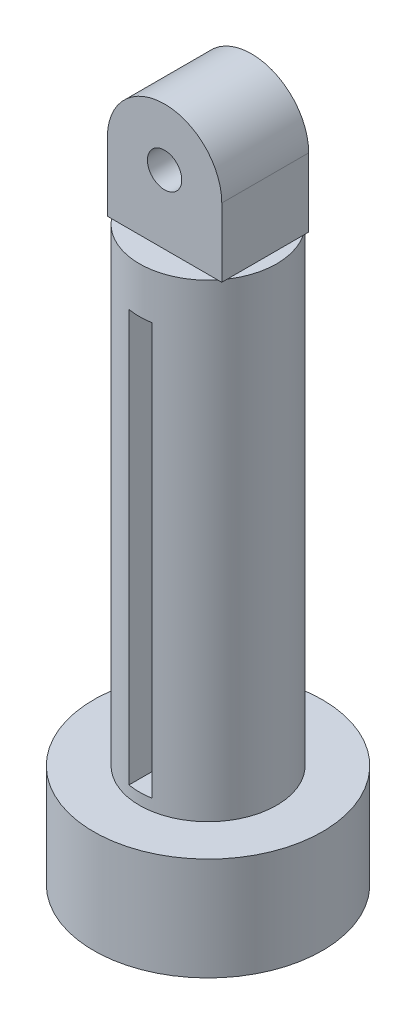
ISO-10303-21;
HEADER;
FILE_DESCRIPTION(('STEP AP214'),'2;1');
FILE_NAME('part.step','',(''),(''),'','','');
FILE_SCHEMA(('AUTOMOTIVE_DESIGN { 1 0 10303 214 1 1 1 1 }'));
ENDSEC;
DATA;
#1=APPLICATION_CONTEXT('core data for automotive mechanical design processes');
#2=APPLICATION_PROTOCOL_DEFINITION('international standard','automotive_design',2000,#1);
#3=PRODUCT_CONTEXT('',#1,'mechanical');
#4=PRODUCT('Part','Part','',(#3));
#5=PRODUCT_RELATED_PRODUCT_CATEGORY('part','',(#4));
#6=PRODUCT_DEFINITION_FORMATION('','',#4);
#7=PRODUCT_DEFINITION_CONTEXT('part definition',#1,'design');
#8=PRODUCT_DEFINITION('design','',#6,#7);
#9=PRODUCT_DEFINITION_SHAPE('','',#8);
#10=(LENGTH_UNIT() NAMED_UNIT(*) SI_UNIT(.MILLI.,.METRE.));
#11=(NAMED_UNIT(*) PLANE_ANGLE_UNIT() SI_UNIT($,.RADIAN.));
#12=(NAMED_UNIT(*) SI_UNIT($,.STERADIAN.) SOLID_ANGLE_UNIT());
#13=UNCERTAINTY_MEASURE_WITH_UNIT(LENGTH_MEASURE(1.E-05),#10,'distance_accuracy_value','');
#14=(GEOMETRIC_REPRESENTATION_CONTEXT(3) GLOBAL_UNCERTAINTY_ASSIGNED_CONTEXT((#13)) GLOBAL_UNIT_ASSIGNED_CONTEXT((#10,
#11,#12)) REPRESENTATION_CONTEXT('',''));
#15=CARTESIAN_POINT('',(0.,0.,0.));
#16=DIRECTION('',(0.,0.,1.));
#17=DIRECTION('',(1.,0.,0.));
#18=AXIS2_PLACEMENT_3D('',#15,#16,#17);
#19=CARTESIAN_POINT('',(-23.3830845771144,26.5671641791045,8.));
#20=DIRECTION('',(1.,0.,0.));
#21=DIRECTION('',(0.,0.,-1.));
#22=AXIS2_PLACEMENT_3D('',#19,#20,#21);
#23=PLANE('',#22);
#24=DIRECTION('',(0.,1.,0.));
#25=VECTOR('',#24,1.);
#26=CARTESIAN_POINT('',(-23.3830845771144,15.5671641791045,0.2));
#27=LINE('',#26,#25);
#28=CARTESIAN_POINT('',(-23.3830845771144,15.5671641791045,0.2));
#29=VERTEX_POINT('',#28);
#30=CARTESIAN_POINT('',(-23.3830845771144,21.5671641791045,0.2));
#31=VERTEX_POINT('',#30);
#32=EDGE_CURVE('E198',#29,#31,#27,.T.);
#33=ORIENTED_EDGE('',*,*,#32,.F.);
#34=DIRECTION('',(0.,0.,-1.));
#35=VECTOR('',#34,1.);
#36=CARTESIAN_POINT('',(-23.3830845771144,15.5671641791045,8.));
#37=LINE('',#36,#35);
#38=CARTESIAN_POINT('',(-23.3830845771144,15.5671641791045,0.683375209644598));
#39=VERTEX_POINT('',#38);
#40=EDGE_CURVE('E230',#39,#29,#37,.T.);
#41=ORIENTED_EDGE('',*,*,#40,.F.);
#42=CARTESIAN_POINT('',(-23.3830845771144,15.5671641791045,7.3166247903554));
#43=VERTEX_POINT('',#42);
#44=EDGE_CURVE('E235',#43,#39,#37,.T.);
#45=ORIENTED_EDGE('',*,*,#44,.F.);
#46=CARTESIAN_POINT('',(-23.3830845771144,15.5671641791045,7.8));
#47=VERTEX_POINT('',#46);
#48=EDGE_CURVE('E232',#47,#43,#37,.T.);
#49=ORIENTED_EDGE('',*,*,#48,.F.);
#50=DIRECTION('',(0.,-1.,0.));
#51=VECTOR('',#50,1.);
#52=CARTESIAN_POINT('',(-23.3830845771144,21.5671641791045,7.8));
#53=LINE('',#52,#51);
#54=CARTESIAN_POINT('',(-23.3830845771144,21.5671641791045,7.8));
#55=VERTEX_POINT('',#54);
#56=EDGE_CURVE('E244',#55,#47,#53,.T.);
#57=ORIENTED_EDGE('',*,*,#56,.F.);
#58=DIRECTION('',(0.,0.,1.));
#59=VECTOR('',#58,1.);
#60=CARTESIAN_POINT('',(-23.3830845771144,21.5671641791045,0.));
#61=LINE('',#60,#59);
#62=EDGE_CURVE('E218',#31,#55,#61,.T.);
#63=ORIENTED_EDGE('',*,*,#62,.F.);
#64=EDGE_LOOP('',(#33,#41,#45,#49,#57,#63));
#65=FACE_BOUND('',#64,.T.);
#66=ADVANCED_FACE('F79',(#65),#23,.F.);
#67=CARTESIAN_POINT('',(-13.3830845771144,26.5671641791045,8.));
#68=DIRECTION('',(-1.,0.,0.));
#69=DIRECTION('',(0.,-1.,0.));
#70=AXIS2_PLACEMENT_3D('',#67,#68,#69);
#71=PLANE('',#70);
#72=DIRECTION('',(0.,-1.,0.));
#73=VECTOR('',#72,1.);
#74=CARTESIAN_POINT('',(-13.3830845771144,21.5671641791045,0.2));
#75=LINE('',#74,#73);
#76=CARTESIAN_POINT('',(-13.3830845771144,21.5671641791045,0.2));
#77=VERTEX_POINT('',#76);
#78=CARTESIAN_POINT('',(-13.3830845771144,15.5671641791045,0.2));
#79=VERTEX_POINT('',#78);
#80=EDGE_CURVE('E195',#77,#79,#75,.T.);
#81=ORIENTED_EDGE('',*,*,#80,.F.);
#82=DIRECTION('',(0.,0.,1.));
#83=VECTOR('',#82,1.);
#84=CARTESIAN_POINT('',(-13.3830845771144,21.5671641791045,0.));
#85=LINE('',#84,#83);
#86=CARTESIAN_POINT('',(-13.3830845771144,21.5671641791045,7.8));
#87=VERTEX_POINT('',#86);
#88=EDGE_CURVE('E207',#77,#87,#85,.T.);
#89=ORIENTED_EDGE('',*,*,#88,.T.);
#90=DIRECTION('',(0.,1.,0.));
#91=VECTOR('',#90,1.);
#92=CARTESIAN_POINT('',(-13.3830845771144,15.5671641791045,7.8));
#93=LINE('',#92,#91);
#94=CARTESIAN_POINT('',(-13.3830845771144,15.5671641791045,7.8));
#95=VERTEX_POINT('',#94);
#96=EDGE_CURVE('E255',#95,#87,#93,.T.);
#97=ORIENTED_EDGE('',*,*,#96,.F.);
#98=DIRECTION('',(0.,0.,-1.));
#99=VECTOR('',#98,1.);
#100=CARTESIAN_POINT('',(-13.3830845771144,15.5671641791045,8.));
#101=LINE('',#100,#99);
#102=CARTESIAN_POINT('',(-13.3830845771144,15.5671641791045,7.3166247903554));
#103=VERTEX_POINT('',#102);
#104=EDGE_CURVE('E228',#95,#103,#101,.T.);
#105=ORIENTED_EDGE('',*,*,#104,.T.);
#106=CARTESIAN_POINT('',(-13.3830845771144,15.5671641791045,0.683375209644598));
#107=VERTEX_POINT('',#106);
#108=EDGE_CURVE('E231',#103,#107,#101,.T.);
#109=ORIENTED_EDGE('',*,*,#108,.T.);
#110=EDGE_CURVE('E211',#107,#79,#101,.T.);
#111=ORIENTED_EDGE('',*,*,#110,.T.);
#112=EDGE_LOOP('',(#81,#89,#97,#105,#109,#111));
#113=FACE_BOUND('',#112,.T.);
#114=ADVANCED_FACE('F205',(#113),#71,.F.);
#115=CARTESIAN_POINT('',(-18.3830845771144,21.5671641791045,0.));
#116=DIRECTION('',(0.,0.,1.));
#117=DIRECTION('',(1.,0.,0.));
#118=AXIS2_PLACEMENT_3D('',#115,#116,#117);
#119=CYLINDRICAL_SURFACE('',#118,5.);
#120=ORIENTED_EDGE('',*,*,#88,.F.);
#121=CARTESIAN_POINT('',(-18.3830845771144,21.5671641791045,0.2));
#122=DIRECTION('',(0.,0.,-1.));
#123=DIRECTION('',(-1.,0.,0.));
#124=AXIS2_PLACEMENT_3D('',#121,#122,#123);
#125=CIRCLE('',#124,5.);
#126=EDGE_CURVE('E190',#31,#77,#125,.T.);
#127=ORIENTED_EDGE('',*,*,#126,.F.);
#128=ORIENTED_EDGE('',*,*,#62,.T.);
#129=CARTESIAN_POINT('',(-18.3830845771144,21.5671641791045,7.8));
#130=DIRECTION('',(0.,0.,1.));
#131=DIRECTION('',(1.,0.,0.));
#132=AXIS2_PLACEMENT_3D('',#129,#130,#131);
#133=CIRCLE('',#132,5.);
#134=EDGE_CURVE('E217',#87,#55,#133,.T.);
#135=ORIENTED_EDGE('',*,*,#134,.F.);
#136=EDGE_LOOP('',(#120,#127,#128,#135));
#137=FACE_BOUND('',#136,.T.);
#138=ADVANCED_FACE('F215',(#137),#119,.T.);
#139=CARTESIAN_POINT('',(-18.3830845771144,21.5671641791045,0.));
#140=DIRECTION('',(0.,0.,1.));
#141=DIRECTION('',(1.,0.,0.));
#142=AXIS2_PLACEMENT_3D('',#139,#140,#141);
#143=CYLINDRICAL_SURFACE('',#142,1.5);
#144=CARTESIAN_POINT('',(-18.3830845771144,21.5671641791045,7.8));
#145=DIRECTION('',(0.,0.,1.));
#146=DIRECTION('',(1.,0.,0.));
#147=AXIS2_PLACEMENT_3D('',#144,#145,#146);
#148=CIRCLE('',#147,1.5);
#149=CARTESIAN_POINT('',(-16.8830845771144,21.5671641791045,7.8));
#150=VERTEX_POINT('',#149);
#151=EDGE_CURVE('E241',#150,#150,#148,.F.);
#152=ORIENTED_EDGE('',*,*,#151,.F.);
#153=EDGE_LOOP('',(#152));
#154=FACE_BOUND('',#153,.T.);
#155=CARTESIAN_POINT('',(-18.3830845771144,21.5671641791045,0.2));
#156=DIRECTION('',(0.,0.,-1.));
#157=DIRECTION('',(-1.,0.,0.));
#158=AXIS2_PLACEMENT_3D('',#155,#156,#157);
#159=CIRCLE('',#158,1.5);
#160=CARTESIAN_POINT('',(-19.8830845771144,21.5671641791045,0.2));
#161=VERTEX_POINT('',#160);
#162=EDGE_CURVE('E376',#161,#161,#159,.F.);
#163=ORIENTED_EDGE('',*,*,#162,.F.);
#164=EDGE_LOOP('',(#163));
#165=FACE_BOUND('',#164,.T.);
#166=ADVANCED_FACE('F422',(#154,#165),#143,.F.);
#167=CARTESIAN_POINT('',(-23.3830845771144,15.5671641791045,8.));
#168=DIRECTION('',(0.,1.,0.));
#169=DIRECTION('',(0.,0.,1.));
#170=AXIS2_PLACEMENT_3D('',#167,#168,#169);
#171=PLANE('',#170);
#172=DIRECTION('',(-1.,0.,0.));
#173=VECTOR('',#172,1.);
#174=CARTESIAN_POINT('',(-13.3830845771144,15.5671641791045,0.2));
#175=LINE('',#174,#173);
#176=CARTESIAN_POINT('',(-13.7398098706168,15.5671641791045,0.2));
#177=VERTEX_POINT('',#176);
#178=EDGE_CURVE('E377',#79,#177,#175,.T.);
#179=ORIENTED_EDGE('',*,*,#178,.F.);
#180=ORIENTED_EDGE('',*,*,#110,.F.);
#181=CARTESIAN_POINT('',(-18.3830845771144,15.5671641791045,4.));
#182=DIRECTION('',(0.,-1.,0.));
#183=DIRECTION('',(0.,0.,-1.));
#184=AXIS2_PLACEMENT_3D('',#181,#182,#183);
#185=CIRCLE('',#184,6.);
#186=EDGE_CURVE('E223',#177,#107,#185,.T.);
#187=ORIENTED_EDGE('',*,*,#186,.F.);
#188=EDGE_LOOP('',(#179,#180,#187));
#189=FACE_BOUND('',#188,.T.);
#190=ADVANCED_FACE('F399',(#189),#171,.F.);
#191=DIRECTION('',(-1.,0.,0.));
#192=VECTOR('',#191,1.);
#193=CARTESIAN_POINT('',(-23.3830845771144,15.5671641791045,0.2));
#194=LINE('',#193,#192);
#195=CARTESIAN_POINT('',(-23.026359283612,15.5671641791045,0.2));
#196=VERTEX_POINT('',#195);
#197=EDGE_CURVE('E12',#196,#29,#194,.T.);
#198=ORIENTED_EDGE('',*,*,#197,.F.);
#199=EDGE_CURVE('E225',#39,#196,#185,.T.);
#200=ORIENTED_EDGE('',*,*,#199,.F.);
#201=ORIENTED_EDGE('',*,*,#40,.T.);
#202=EDGE_LOOP('',(#198,#200,#201));
#203=FACE_BOUND('',#202,.T.);
#204=ADVANCED_FACE('F381',(#203),#171,.F.);
#205=DIRECTION('',(1.,0.,0.));
#206=VECTOR('',#205,1.);
#207=CARTESIAN_POINT('',(-13.9109486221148,15.5671641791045,7.8));
#208=LINE('',#207,#206);
#209=CARTESIAN_POINT('',(-13.7398098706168,15.5671641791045,7.8));
#210=VERTEX_POINT('',#209);
#211=EDGE_CURVE('E445',#210,#95,#208,.T.);
#212=ORIENTED_EDGE('',*,*,#211,.F.);
#213=EDGE_CURVE('E239',#103,#210,#185,.T.);
#214=ORIENTED_EDGE('',*,*,#213,.F.);
#215=ORIENTED_EDGE('',*,*,#104,.F.);
#216=EDGE_LOOP('',(#212,#214,#215));
#217=FACE_BOUND('',#216,.T.);
#218=ADVANCED_FACE('F432',(#217),#171,.F.);
#219=CARTESIAN_POINT('',(-23.026359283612,15.5671641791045,7.8));
#220=VERTEX_POINT('',#219);
#221=EDGE_CURVE('E441',#47,#220,#208,.T.);
#222=ORIENTED_EDGE('',*,*,#221,.F.);
#223=ORIENTED_EDGE('',*,*,#48,.T.);
#224=EDGE_CURVE('E391',#220,#43,#185,.T.);
#225=ORIENTED_EDGE('',*,*,#224,.F.);
#226=EDGE_LOOP('',(#222,#223,#225));
#227=FACE_BOUND('',#226,.T.);
#228=ADVANCED_FACE('F428',(#227),#171,.F.);
#229=CARTESIAN_POINT('',(0.,-29.4328358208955,0.));
#230=DIRECTION('',(0.,-1.,0.));
#231=DIRECTION('',(0.,0.,-1.));
#232=AXIS2_PLACEMENT_3D('',#229,#230,#231);
#233=PLANE('',#232);
#234=CARTESIAN_POINT('',(-18.3830845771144,-29.4328358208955,4.));
#235=DIRECTION('',(0.,-1.,0.));
#236=DIRECTION('',(0.,0.,-1.));
#237=AXIS2_PLACEMENT_3D('',#234,#235,#236);
#238=CIRCLE('',#237,3.25);
#239=CARTESIAN_POINT('',(-18.3830845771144,-29.4328358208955,0.749999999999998));
#240=VERTEX_POINT('',#239);
#241=EDGE_CURVE('E317',#240,#240,#238,.T.);
#242=ORIENTED_EDGE('',*,*,#241,.F.);
#243=EDGE_LOOP('',(#242));
#244=FACE_BOUND('',#243,.T.);
#245=CARTESIAN_POINT('',(-18.3830845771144,-29.4328358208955,4.));
#246=DIRECTION('',(0.,-1.,0.));
#247=DIRECTION('',(0.,0.,-1.));
#248=AXIS2_PLACEMENT_3D('',#245,#246,#247);
#249=CIRCLE('',#248,8.);
#250=CARTESIAN_POINT('',(-18.3830845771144,-29.4328358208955,-4.));
#251=VERTEX_POINT('',#250);
#252=EDGE_CURVE('E86',#251,#251,#249,.F.);
#253=ORIENTED_EDGE('',*,*,#252,.F.);
#254=EDGE_LOOP('',(#253));
#255=FACE_BOUND('',#254,.T.);
#256=ADVANCED_FACE('F418',(#244,#255),#233,.T.);
#257=CARTESIAN_POINT('',(-18.3830845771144,-29.4328358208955,4.));
#258=DIRECTION('',(0.,1.,0.));
#259=DIRECTION('',(0.,0.,1.));
#260=AXIS2_PLACEMENT_3D('',#257,#258,#259);
#261=CYLINDRICAL_SURFACE('',#260,6.);
#262=CARTESIAN_POINT('',(-18.3830845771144,11.5671641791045,4.));
#263=DIRECTION('',(0.,-1.,0.));
#264=DIRECTION('',(0.,0.,-1.));
#265=AXIS2_PLACEMENT_3D('',#262,#263,#264);
#266=CIRCLE('',#265,6.);
#267=CARTESIAN_POINT('',(-17.3830845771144,11.5671641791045,9.91607978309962));
#268=VERTEX_POINT('',#267);
#269=CARTESIAN_POINT('',(-19.3830845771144,11.5671641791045,9.91607978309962));
#270=VERTEX_POINT('',#269);
#271=EDGE_CURVE('E275',#268,#270,#266,.T.);
#272=ORIENTED_EDGE('',*,*,#271,.F.);
#273=DIRECTION('',(0.,-1.,0.));
#274=VECTOR('',#273,1.);
#275=CARTESIAN_POINT('',(-17.3830845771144,11.5671641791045,9.91607978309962));
#276=LINE('',#275,#274);
#277=CARTESIAN_POINT('',(-17.3830845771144,-24.4328358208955,9.91607978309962));
#278=VERTEX_POINT('',#277);
#279=EDGE_CURVE('E286',#268,#278,#276,.T.);
#280=ORIENTED_EDGE('',*,*,#279,.T.);
#281=CARTESIAN_POINT('',(-18.3830845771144,-24.4328358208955,4.));
#282=DIRECTION('',(0.,-1.,0.));
#283=DIRECTION('',(0.,0.,-1.));
#284=AXIS2_PLACEMENT_3D('',#281,#282,#283);
#285=CIRCLE('',#284,6.);
#286=CARTESIAN_POINT('',(-19.3830845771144,-24.4328358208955,9.91607978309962));
#287=VERTEX_POINT('',#286);
#288=EDGE_CURVE('E268',#278,#287,#285,.T.);
#289=ORIENTED_EDGE('',*,*,#288,.T.);
#290=DIRECTION('',(0.,-1.,0.));
#291=VECTOR('',#290,1.);
#292=CARTESIAN_POINT('',(-19.3830845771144,11.5671641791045,9.91607978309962));
#293=LINE('',#292,#291);
#294=EDGE_CURVE('E284',#270,#287,#293,.T.);
#295=ORIENTED_EDGE('',*,*,#294,.F.);
#296=EDGE_LOOP('',(#272,#280,#289,#295));
#297=FACE_BOUND('',#296,.T.);
#298=DIRECTION('',(0.,1.,0.));
#299=VECTOR('',#298,1.);
#300=CARTESIAN_POINT('',(-19.3830845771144,-24.4328358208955,-1.91607978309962));
#301=LINE('',#300,#299);
#302=CARTESIAN_POINT('',(-19.3830845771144,-24.4328358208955,-1.91607978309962));
#303=VERTEX_POINT('',#302);
#304=CARTESIAN_POINT('',(-19.3830845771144,11.5671641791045,-1.91607978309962));
#305=VERTEX_POINT('',#304);
#306=EDGE_CURVE('E312',#303,#305,#301,.T.);
#307=ORIENTED_EDGE('',*,*,#306,.F.);
#308=CARTESIAN_POINT('',(-18.3830845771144,-24.4328358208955,4.));
#309=DIRECTION('',(0.,-1.,0.));
#310=DIRECTION('',(0.,0.,-1.));
#311=AXIS2_PLACEMENT_3D('',#308,#309,#310);
#312=CIRCLE('',#311,6.);
#313=CARTESIAN_POINT('',(-17.3830845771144,-24.4328358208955,-1.91607978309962));
#314=VERTEX_POINT('',#313);
#315=EDGE_CURVE('E301',#303,#314,#312,.T.);
#316=ORIENTED_EDGE('',*,*,#315,.T.);
#317=DIRECTION('',(0.,1.,0.));
#318=VECTOR('',#317,1.);
#319=CARTESIAN_POINT('',(-17.3830845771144,-24.4328358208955,-1.91607978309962));
#320=LINE('',#319,#318);
#321=CARTESIAN_POINT('',(-17.3830845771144,11.5671641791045,-1.91607978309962));
#322=VERTEX_POINT('',#321);
#323=EDGE_CURVE('E309',#314,#322,#320,.T.);
#324=ORIENTED_EDGE('',*,*,#323,.T.);
#325=CARTESIAN_POINT('',(-18.3830845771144,11.5671641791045,4.));
#326=DIRECTION('',(0.,-1.,0.));
#327=DIRECTION('',(0.,0.,-1.));
#328=AXIS2_PLACEMENT_3D('',#325,#326,#327);
#329=CIRCLE('',#328,6.);
#330=EDGE_CURVE('E291',#305,#322,#329,.T.);
#331=ORIENTED_EDGE('',*,*,#330,.F.);
#332=EDGE_LOOP('',(#307,#316,#324,#331));
#333=FACE_BOUND('',#332,.T.);
#334=EDGE_CURVE('E219',#196,#177,#185,.T.);
#335=ORIENTED_EDGE('',*,*,#334,.T.);
#336=ORIENTED_EDGE('',*,*,#186,.T.);
#337=EDGE_CURVE('E392',#107,#103,#185,.T.);
#338=ORIENTED_EDGE('',*,*,#337,.T.);
#339=ORIENTED_EDGE('',*,*,#213,.T.);
#340=EDGE_CURVE('E394',#210,#220,#185,.T.);
#341=ORIENTED_EDGE('',*,*,#340,.T.);
#342=ORIENTED_EDGE('',*,*,#224,.T.);
#343=EDGE_CURVE('E320',#43,#39,#185,.T.);
#344=ORIENTED_EDGE('',*,*,#343,.T.);
#345=ORIENTED_EDGE('',*,*,#199,.T.);
#346=EDGE_LOOP('',(#335,#336,#338,#339,#341,#342,#344,#345));
#347=FACE_BOUND('',#346,.T.);
#348=CARTESIAN_POINT('',(-18.3830845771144,-25.4328358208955,4.));
#349=DIRECTION('',(0.,-1.,0.));
#350=DIRECTION('',(0.,0.,-1.));
#351=AXIS2_PLACEMENT_3D('',#348,#349,#350);
#352=CIRCLE('',#351,6.);
#353=CARTESIAN_POINT('',(-18.3830845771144,-25.4328358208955,-2.));
#354=VERTEX_POINT('',#353);
#355=EDGE_CURVE('E236',#354,#354,#352,.T.);
#356=ORIENTED_EDGE('',*,*,#355,.F.);
#357=EDGE_LOOP('',(#356));
#358=FACE_BOUND('',#357,.T.);
#359=ADVANCED_FACE('F341',(#297,#333,#347,#358),#261,.T.);
#360=CARTESIAN_POINT('',(-18.3830845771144,11.5671641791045,4.));
#361=DIRECTION('',(0.,-1.,0.));
#362=DIRECTION('',(0.,0.,-1.));
#363=AXIS2_PLACEMENT_3D('',#360,#361,#362);
#364=CYLINDRICAL_SURFACE('',#363,3.25);
#365=ORIENTED_EDGE('',*,*,#241,.T.);
#366=EDGE_LOOP('',(#365));
#367=FACE_BOUND('',#366,.T.);
#368=DIRECTION('',(0.,-1.,0.));
#369=VECTOR('',#368,1.);
#370=CARTESIAN_POINT('',(-19.3830845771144,11.5671641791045,7.09232921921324));
#371=LINE('',#370,#369);
#372=CARTESIAN_POINT('',(-19.3830845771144,11.5671641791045,7.09232921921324));
#373=VERTEX_POINT('',#372);
#374=CARTESIAN_POINT('',(-19.3830845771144,-24.4328358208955,7.09232921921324));
#375=VERTEX_POINT('',#374);
#376=EDGE_CURVE('E281',#373,#375,#371,.T.);
#377=ORIENTED_EDGE('',*,*,#376,.T.);
#378=CARTESIAN_POINT('',(-18.3830845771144,-24.4328358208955,4.));
#379=DIRECTION('',(0.,-1.,0.));
#380=DIRECTION('',(0.,0.,-1.));
#381=AXIS2_PLACEMENT_3D('',#378,#379,#380);
#382=CIRCLE('',#381,3.25);
#383=CARTESIAN_POINT('',(-17.3830845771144,-24.4328358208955,7.09232921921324));
#384=VERTEX_POINT('',#383);
#385=EDGE_CURVE('E264',#384,#375,#382,.T.);
#386=ORIENTED_EDGE('',*,*,#385,.F.);
#387=DIRECTION('',(0.,-1.,0.));
#388=VECTOR('',#387,1.);
#389=CARTESIAN_POINT('',(-17.3830845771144,11.5671641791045,7.09232921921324));
#390=LINE('',#389,#388);
#391=CARTESIAN_POINT('',(-17.3830845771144,11.5671641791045,7.09232921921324));
#392=VERTEX_POINT('',#391);
#393=EDGE_CURVE('E280',#392,#384,#390,.T.);
#394=ORIENTED_EDGE('',*,*,#393,.F.);
#395=CARTESIAN_POINT('',(-18.3830845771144,11.5671641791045,4.));
#396=DIRECTION('',(0.,-1.,0.));
#397=DIRECTION('',(0.,0.,-1.));
#398=AXIS2_PLACEMENT_3D('',#395,#396,#397);
#399=CIRCLE('',#398,3.25);
#400=CARTESIAN_POINT('',(-17.3830845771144,11.5671641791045,0.907670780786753));
#401=VERTEX_POINT('',#400);
#402=EDGE_CURVE('E318',#401,#392,#399,.T.);
#403=ORIENTED_EDGE('',*,*,#402,.F.);
#404=DIRECTION('',(0.,1.,0.));
#405=VECTOR('',#404,1.);
#406=CARTESIAN_POINT('',(-17.3830845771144,-24.4328358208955,0.907670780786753));
#407=LINE('',#406,#405);
#408=CARTESIAN_POINT('',(-17.3830845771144,-24.4328358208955,0.907670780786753));
#409=VERTEX_POINT('',#408);
#410=EDGE_CURVE('E306',#409,#401,#407,.T.);
#411=ORIENTED_EDGE('',*,*,#410,.F.);
#412=CARTESIAN_POINT('',(-18.3830845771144,-24.4328358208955,4.));
#413=DIRECTION('',(0.,-1.,0.));
#414=DIRECTION('',(0.,0.,-1.));
#415=AXIS2_PLACEMENT_3D('',#412,#413,#414);
#416=CIRCLE('',#415,3.25);
#417=CARTESIAN_POINT('',(-19.3830845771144,-24.4328358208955,0.907670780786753));
#418=VERTEX_POINT('',#417);
#419=EDGE_CURVE('E295',#418,#409,#416,.T.);
#420=ORIENTED_EDGE('',*,*,#419,.F.);
#421=DIRECTION('',(0.,1.,0.));
#422=VECTOR('',#421,1.);
#423=CARTESIAN_POINT('',(-19.3830845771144,-24.4328358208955,0.907670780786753));
#424=LINE('',#423,#422);
#425=CARTESIAN_POINT('',(-19.3830845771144,11.5671641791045,0.907670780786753));
#426=VERTEX_POINT('',#425);
#427=EDGE_CURVE('E314',#418,#426,#424,.T.);
#428=ORIENTED_EDGE('',*,*,#427,.T.);
#429=EDGE_CURVE('E321',#373,#426,#399,.T.);
#430=ORIENTED_EDGE('',*,*,#429,.F.);
#431=EDGE_LOOP('',(#377,#386,#394,#403,#411,#420,#428,#430));
#432=FACE_BOUND('',#431,.T.);
#433=ADVANCED_FACE('F329',(#367,#432),#364,.F.);
#434=CARTESIAN_POINT('',(0.,15.5671641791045,0.));
#435=DIRECTION('',(0.,-1.,0.));
#436=DIRECTION('',(0.,0.,-1.));
#437=AXIS2_PLACEMENT_3D('',#434,#435,#436);
#438=PLANE('',#437);
#439=ORIENTED_EDGE('',*,*,#334,.F.);
#440=EDGE_CURVE('E212',#177,#196,#175,.T.);
#441=ORIENTED_EDGE('',*,*,#440,.F.);
#442=EDGE_LOOP('',(#439,#441));
#443=FACE_BOUND('',#442,.T.);
#444=ADVANCED_FACE('F406',(#443),#438,.F.);
#445=ORIENTED_EDGE('',*,*,#108,.F.);
#446=ORIENTED_EDGE('',*,*,#337,.F.);
#447=EDGE_LOOP('',(#445,#446));
#448=FACE_BOUND('',#447,.T.);
#449=ADVANCED_FACE('F404',(#448),#438,.F.);
#450=ORIENTED_EDGE('',*,*,#343,.F.);
#451=ORIENTED_EDGE('',*,*,#44,.T.);
#452=EDGE_LOOP('',(#450,#451));
#453=FACE_BOUND('',#452,.T.);
#454=ADVANCED_FACE('F386',(#453),#438,.F.);
#455=ORIENTED_EDGE('',*,*,#340,.F.);
#456=EDGE_CURVE('E443',#220,#210,#208,.T.);
#457=ORIENTED_EDGE('',*,*,#456,.F.);
#458=EDGE_LOOP('',(#455,#457));
#459=FACE_BOUND('',#458,.T.);
#460=ADVANCED_FACE('F412',(#459),#438,.F.);
#461=CARTESIAN_POINT('',(0.,11.5671641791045,0.));
#462=DIRECTION('',(0.,-1.,0.));
#463=DIRECTION('',(0.,0.,-1.));
#464=AXIS2_PLACEMENT_3D('',#461,#462,#463);
#465=PLANE('',#464);
#466=ORIENTED_EDGE('',*,*,#402,.T.);
#467=DIRECTION('',(0.,0.,1.));
#468=VECTOR('',#467,1.);
#469=CARTESIAN_POINT('',(-17.3830845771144,11.5671641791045,0.));
#470=LINE('',#469,#468);
#471=EDGE_CURVE('E272',#392,#268,#470,.T.);
#472=ORIENTED_EDGE('',*,*,#471,.T.);
#473=ORIENTED_EDGE('',*,*,#271,.T.);
#474=DIRECTION('',(0.,0.,1.));
#475=VECTOR('',#474,1.);
#476=CARTESIAN_POINT('',(-19.3830845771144,11.5671641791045,0.));
#477=LINE('',#476,#475);
#478=EDGE_CURVE('E278',#373,#270,#477,.T.);
#479=ORIENTED_EDGE('',*,*,#478,.F.);
#480=ORIENTED_EDGE('',*,*,#429,.T.);
#481=DIRECTION('',(0.,0.,1.));
#482=VECTOR('',#481,1.);
#483=CARTESIAN_POINT('',(-19.3830845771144,11.5671641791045,0.));
#484=LINE('',#483,#482);
#485=EDGE_CURVE('E101',#305,#426,#484,.T.);
#486=ORIENTED_EDGE('',*,*,#485,.F.);
#487=ORIENTED_EDGE('',*,*,#330,.T.);
#488=DIRECTION('',(0.,0.,1.));
#489=VECTOR('',#488,1.);
#490=CARTESIAN_POINT('',(-17.3830845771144,11.5671641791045,0.));
#491=LINE('',#490,#489);
#492=EDGE_CURVE('E293',#322,#401,#491,.T.);
#493=ORIENTED_EDGE('',*,*,#492,.T.);
#494=EDGE_LOOP('',(#466,#472,#473,#479,#480,#486,#487,#493));
#495=FACE_BOUND('',#494,.T.);
#496=ADVANCED_FACE('F327',(#495),#465,.T.);
#497=CARTESIAN_POINT('',(-19.3830845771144,-24.4328358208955,0.));
#498=DIRECTION('',(-1.,0.,0.));
#499=DIRECTION('',(0.,0.,1.));
#500=AXIS2_PLACEMENT_3D('',#497,#498,#499);
#501=PLANE('',#500);
#502=ORIENTED_EDGE('',*,*,#427,.F.);
#503=DIRECTION('',(0.,0.,1.));
#504=VECTOR('',#503,1.);
#505=CARTESIAN_POINT('',(-19.3830845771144,-24.4328358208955,0.));
#506=LINE('',#505,#504);
#507=EDGE_CURVE('E298',#303,#418,#506,.T.);
#508=ORIENTED_EDGE('',*,*,#507,.F.);
#509=ORIENTED_EDGE('',*,*,#306,.T.);
#510=ORIENTED_EDGE('',*,*,#485,.T.);
#511=EDGE_LOOP('',(#502,#508,#509,#510));
#512=FACE_BOUND('',#511,.T.);
#513=ADVANCED_FACE('F335',(#512),#501,.F.);
#514=CARTESIAN_POINT('',(-17.3830845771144,-24.4328358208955,0.));
#515=DIRECTION('',(-1.,0.,0.));
#516=DIRECTION('',(0.,0.,1.));
#517=AXIS2_PLACEMENT_3D('',#514,#515,#516);
#518=PLANE('',#517);
#519=ORIENTED_EDGE('',*,*,#323,.F.);
#520=DIRECTION('',(0.,0.,1.));
#521=VECTOR('',#520,1.);
#522=CARTESIAN_POINT('',(-17.3830845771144,-24.4328358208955,0.));
#523=LINE('',#522,#521);
#524=EDGE_CURVE('E304',#314,#409,#523,.T.);
#525=ORIENTED_EDGE('',*,*,#524,.T.);
#526=ORIENTED_EDGE('',*,*,#410,.T.);
#527=ORIENTED_EDGE('',*,*,#492,.F.);
#528=EDGE_LOOP('',(#519,#525,#526,#527));
#529=FACE_BOUND('',#528,.T.);
#530=ADVANCED_FACE('F346',(#529),#518,.T.);
#531=CARTESIAN_POINT('',(0.,-24.4328358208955,0.));
#532=DIRECTION('',(0.,-1.,0.));
#533=DIRECTION('',(0.,0.,-1.));
#534=AXIS2_PLACEMENT_3D('',#531,#532,#533);
#535=PLANE('',#534);
#536=ORIENTED_EDGE('',*,*,#419,.T.);
#537=ORIENTED_EDGE('',*,*,#524,.F.);
#538=ORIENTED_EDGE('',*,*,#315,.F.);
#539=ORIENTED_EDGE('',*,*,#507,.T.);
#540=EDGE_LOOP('',(#536,#537,#538,#539));
#541=FACE_BOUND('',#540,.T.);
#542=ADVANCED_FACE('F338',(#541),#535,.F.);
#543=CARTESIAN_POINT('',(-19.3830845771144,11.5671641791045,0.));
#544=DIRECTION('',(1.,0.,0.));
#545=DIRECTION('',(0.,0.,-1.));
#546=AXIS2_PLACEMENT_3D('',#543,#544,#545);
#547=PLANE('',#546);
#548=ORIENTED_EDGE('',*,*,#376,.F.);
#549=ORIENTED_EDGE('',*,*,#478,.T.);
#550=ORIENTED_EDGE('',*,*,#294,.T.);
#551=DIRECTION('',(0.,0.,1.));
#552=VECTOR('',#551,1.);
#553=CARTESIAN_POINT('',(-19.3830845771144,-24.4328358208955,0.));
#554=LINE('',#553,#552);
#555=EDGE_CURVE('E93',#375,#287,#554,.T.);
#556=ORIENTED_EDGE('',*,*,#555,.F.);
#557=EDGE_LOOP('',(#548,#549,#550,#556));
#558=FACE_BOUND('',#557,.T.);
#559=ADVANCED_FACE('F354',(#558),#547,.T.);
#560=CARTESIAN_POINT('',(-17.3830845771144,11.5671641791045,0.));
#561=DIRECTION('',(1.,0.,0.));
#562=DIRECTION('',(0.,0.,-1.));
#563=AXIS2_PLACEMENT_3D('',#560,#561,#562);
#564=PLANE('',#563);
#565=ORIENTED_EDGE('',*,*,#279,.F.);
#566=ORIENTED_EDGE('',*,*,#471,.F.);
#567=ORIENTED_EDGE('',*,*,#393,.T.);
#568=DIRECTION('',(0.,0.,1.));
#569=VECTOR('',#568,1.);
#570=CARTESIAN_POINT('',(-17.3830845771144,-24.4328358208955,0.));
#571=LINE('',#570,#569);
#572=EDGE_CURVE('E266',#384,#278,#571,.T.);
#573=ORIENTED_EDGE('',*,*,#572,.T.);
#574=EDGE_LOOP('',(#565,#566,#567,#573));
#575=FACE_BOUND('',#574,.T.);
#576=ADVANCED_FACE('F356',(#575),#564,.F.);
#577=CARTESIAN_POINT('',(0.,-24.4328358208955,0.));
#578=DIRECTION('',(0.,-1.,0.));
#579=DIRECTION('',(0.,0.,-1.));
#580=AXIS2_PLACEMENT_3D('',#577,#578,#579);
#581=PLANE('',#580);
#582=ORIENTED_EDGE('',*,*,#385,.T.);
#583=ORIENTED_EDGE('',*,*,#555,.T.);
#584=ORIENTED_EDGE('',*,*,#288,.F.);
#585=ORIENTED_EDGE('',*,*,#572,.F.);
#586=EDGE_LOOP('',(#582,#583,#584,#585));
#587=FACE_BOUND('',#586,.T.);
#588=ADVANCED_FACE('F362',(#587),#581,.F.);
#589=CARTESIAN_POINT('',(-18.3830845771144,-25.4328358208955,4.));
#590=DIRECTION('',(0.,-1.,0.));
#591=DIRECTION('',(0.,0.,-1.));
#592=AXIS2_PLACEMENT_3D('',#589,#590,#591);
#593=CYLINDRICAL_SURFACE('',#592,10.);
#594=CARTESIAN_POINT('',(-18.3830845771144,-25.4328358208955,4.));
#595=DIRECTION('',(0.,-1.,0.));
#596=DIRECTION('',(0.,0.,-1.));
#597=AXIS2_PLACEMENT_3D('',#594,#595,#596);
#598=CIRCLE('',#597,10.);
#599=CARTESIAN_POINT('',(-18.3830845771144,-25.4328358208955,-6.));
#600=VERTEX_POINT('',#599);
#601=EDGE_CURVE('E261',#600,#600,#598,.T.);
#602=ORIENTED_EDGE('',*,*,#601,.T.);
#603=EDGE_LOOP('',(#602));
#604=FACE_BOUND('',#603,.T.);
#605=CARTESIAN_POINT('',(-18.3830845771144,-34.4328358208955,4.));
#606=DIRECTION('',(0.,-1.,0.));
#607=DIRECTION('',(0.,0.,-1.));
#608=AXIS2_PLACEMENT_3D('',#605,#606,#607);
#609=CIRCLE('',#608,10.);
#610=CARTESIAN_POINT('',(-18.3830845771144,-34.4328358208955,-6.));
#611=VERTEX_POINT('',#610);
#612=EDGE_CURVE('E248',#611,#611,#609,.T.);
#613=ORIENTED_EDGE('',*,*,#612,.F.);
#614=EDGE_LOOP('',(#613));
#615=FACE_BOUND('',#614,.T.);
#616=ADVANCED_FACE('F472',(#604,#615),#593,.T.);
#617=CARTESIAN_POINT('',(0.,-25.4328358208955,0.));
#618=DIRECTION('',(0.,-1.,0.));
#619=DIRECTION('',(0.,0.,-1.));
#620=AXIS2_PLACEMENT_3D('',#617,#618,#619);
#621=PLANE('',#620);
#622=ORIENTED_EDGE('',*,*,#355,.T.);
#623=EDGE_LOOP('',(#622));
#624=FACE_BOUND('',#623,.T.);
#625=ORIENTED_EDGE('',*,*,#601,.F.);
#626=EDGE_LOOP('',(#625));
#627=FACE_BOUND('',#626,.T.);
#628=ADVANCED_FACE('F468',(#624,#627),#621,.F.);
#629=CARTESIAN_POINT('',(-18.3830845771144,-34.4328358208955,4.));
#630=DIRECTION('',(0.,-1.,0.));
#631=DIRECTION('',(0.,0.,-1.));
#632=AXIS2_PLACEMENT_3D('',#629,#630,#631);
#633=PLANE('',#632);
#634=ORIENTED_EDGE('',*,*,#612,.T.);
#635=EDGE_LOOP('',(#634));
#636=FACE_BOUND('',#635,.T.);
#637=CARTESIAN_POINT('',(-18.3830845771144,-34.4328358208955,4.));
#638=DIRECTION('',(0.,-1.,0.));
#639=DIRECTION('',(0.,0.,-1.));
#640=AXIS2_PLACEMENT_3D('',#637,#638,#639);
#641=CIRCLE('',#640,8.);
#642=CARTESIAN_POINT('',(-18.3830845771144,-34.4328358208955,-4.));
#643=VERTEX_POINT('',#642);
#644=EDGE_CURVE('E243',#643,#643,#641,.T.);
#645=ORIENTED_EDGE('',*,*,#644,.F.);
#646=EDGE_LOOP('',(#645));
#647=FACE_BOUND('',#646,.T.);
#648=ADVANCED_FACE('F464',(#636,#647),#633,.T.);
#649=CARTESIAN_POINT('',(-18.3830845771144,-34.4328358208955,4.));
#650=DIRECTION('',(0.,1.,0.));
#651=DIRECTION('',(0.,0.,1.));
#652=AXIS2_PLACEMENT_3D('',#649,#650,#651);
#653=CYLINDRICAL_SURFACE('',#652,8.);
#654=ORIENTED_EDGE('',*,*,#644,.T.);
#655=EDGE_LOOP('',(#654));
#656=FACE_BOUND('',#655,.T.);
#657=ORIENTED_EDGE('',*,*,#252,.T.);
#658=EDGE_LOOP('',(#657));
#659=FACE_BOUND('',#658,.T.);
#660=ADVANCED_FACE('F459',(#656,#659),#653,.F.);
#661=CARTESIAN_POINT('',(-18.3830845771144,21.5671641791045,7.8));
#662=DIRECTION('',(0.,0.,1.));
#663=DIRECTION('',(1.,0.,0.));
#664=AXIS2_PLACEMENT_3D('',#661,#662,#663);
#665=PLANE('',#664);
#666=ORIENTED_EDGE('',*,*,#221,.T.);
#667=ORIENTED_EDGE('',*,*,#456,.T.);
#668=ORIENTED_EDGE('',*,*,#211,.T.);
#669=ORIENTED_EDGE('',*,*,#96,.T.);
#670=ORIENTED_EDGE('',*,*,#134,.T.);
#671=ORIENTED_EDGE('',*,*,#56,.T.);
#672=EDGE_LOOP('',(#666,#667,#668,#669,#670,#671));
#673=FACE_BOUND('',#672,.T.);
#674=ORIENTED_EDGE('',*,*,#151,.T.);
#675=EDGE_LOOP('',(#674));
#676=FACE_BOUND('',#675,.T.);
#677=ADVANCED_FACE('F454',(#673,#676),#665,.T.);
#678=CARTESIAN_POINT('',(-18.3830845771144,21.5671641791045,0.2));
#679=DIRECTION('',(0.,0.,-1.));
#680=DIRECTION('',(-1.,0.,0.));
#681=AXIS2_PLACEMENT_3D('',#678,#679,#680);
#682=PLANE('',#681);
#683=ORIENTED_EDGE('',*,*,#126,.T.);
#684=ORIENTED_EDGE('',*,*,#80,.T.);
#685=ORIENTED_EDGE('',*,*,#178,.T.);
#686=ORIENTED_EDGE('',*,*,#440,.T.);
#687=ORIENTED_EDGE('',*,*,#197,.T.);
#688=ORIENTED_EDGE('',*,*,#32,.T.);
#689=EDGE_LOOP('',(#683,#684,#685,#686,#687,#688));
#690=FACE_BOUND('',#689,.T.);
#691=ORIENTED_EDGE('',*,*,#162,.T.);
#692=EDGE_LOOP('',(#691));
#693=FACE_BOUND('',#692,.T.);
#694=ADVANCED_FACE('F192',(#690,#693),#682,.T.);
#695=CLOSED_SHELL('',(#66,#114,#138,#166,#190,#204,#218,#228,#256,#359,#433,#444,#449,#454,#460,
#496,#513,#530,#542,#559,#576,#588,#616,#628,#648,#660,#677,#694));
#696=MANIFOLD_SOLID_BREP('B2',#695);
#697=ADVANCED_BREP_SHAPE_REPRESENTATION('',(#18,#696),#14);
#698=SHAPE_DEFINITION_REPRESENTATION(#9,#697);
ENDSEC;
END-ISO-10303-21;
